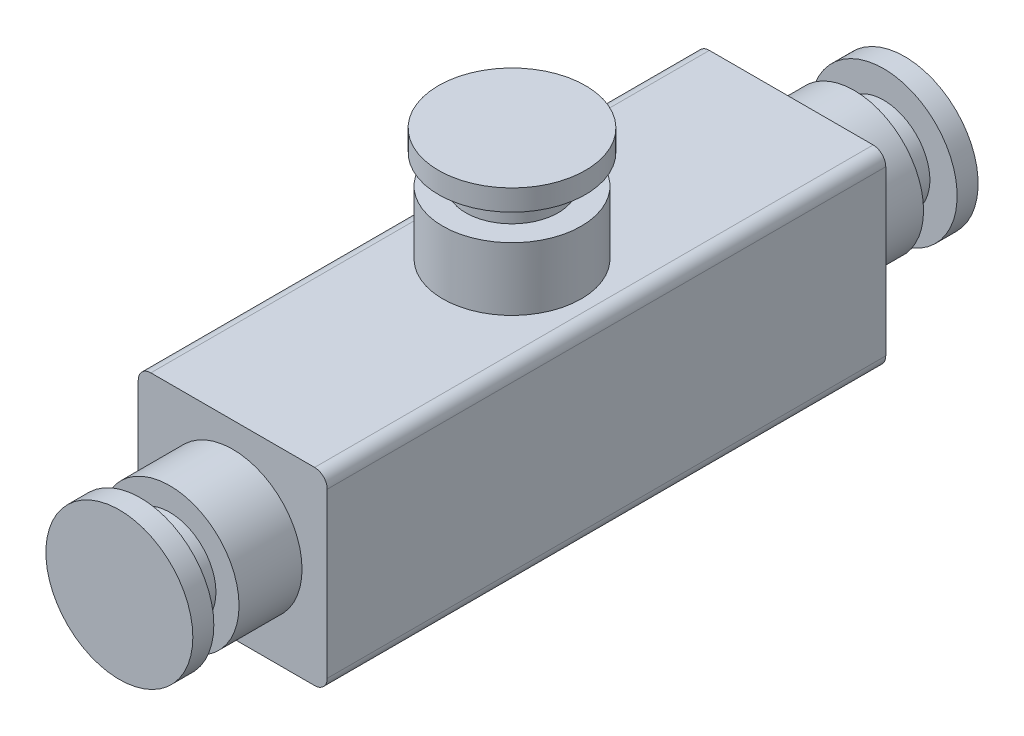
from build123d import *

# Parameters (mm, degrees)
EXTRUDE_2_DEPTH     = 133
SKETCH_2_R          = 16.5
EXTRUDE_3_DEPTH     = 15
SKETCH_3_R          = 16.5
EXTRUDE_4_DEPTH     = 15
EXTRUDE_START       = 15
SKETCH_4_R          = 16.5
EXTRUDE_5_DEPTH     = 15
SKETCH_5_R          = 11
EXTRUDE_6_DEPTH     = 7
SKETCH_6_R          = 11
EXTRUDE_7_DEPTH     = 7
EXTRUDE_START_2     = 7
SKETCH_7_R          = 11
EXTRUDE_8_DEPTH     = 7
SKETCH_8_R          = 17.5
EXTRUDE_9_DEPTH     = 5
SKETCH_9_R          = 17.5
EXTRUDE_10_DEPTH    = 5
EXTRUDE_START_3     = 5
SKETCH_10_R         = 17.5
EXTRUDE_11_DEPTH    = 5
SKETCH_11_R         = 10
CUT_EXTRUDE_1_DEPTH = 5


with BuildPart() as part:
    # Sketch 1 → Extrude 2 (new body)
    with BuildSketch(Plane.XY):
        with BuildLine():
            Line((19.5, 22.5), (-19.5, 22.5))
            ThreePointArc((-19.5, 22.5), (-21.621320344, 21.621320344), (-22.5, 19.5))
            Line((-22.5, 19.5), (-22.5, -19.5))
            ThreePointArc((-22.5, -19.5), (-21.621320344, -21.621320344), (-19.5, -22.5))
            Line((-19.5, -22.5), (19.5, -22.5))
            ThreePointArc((19.5, -22.5), (21.621320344, -21.621320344), (22.5, -19.5))
            Line((22.5, -19.5), (22.5, 19.5))
            ThreePointArc((22.5, 19.5), (21.621320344, 21.621320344), (19.5, 22.5))
        make_face()
    extrude(amount=EXTRUDE_2_DEPTH)

    # Sketch 2 → Extrude 3 (add)
    with BuildSketch(Plane(origin=(0, 22.5, 0), x_dir=(1, 0, 0), z_dir=(0, 1, 0))):
        with Locations((0, -66.5)):
            Circle(SKETCH_2_R)
    extrude(amount=EXTRUDE_3_DEPTH)

    # Sketch 3 → Extrude 4 (add)
    with BuildSketch(Plane.XY.offset(133)):
        Circle(SKETCH_3_R)
    extrude(amount=EXTRUDE_4_DEPTH)

    # Sketch 4 → Extrude 5 (add)
    with BuildSketch(Plane(origin=(0, 0, 0), x_dir=(-1, 0, 0), z_dir=(0, 0, -1)).offset(EXTRUDE_START)):
        with Locations(Location((0, 0, 0), (0, 0, 180))):
            Circle(SKETCH_4_R)
    extrude(amount=-EXTRUDE_5_DEPTH)

    # Sketch 5 → Extrude 6 (add)
    with BuildSketch(Plane(origin=(0, 37.5, 0), x_dir=(1, 0, 0), z_dir=(0, 1, 0))):
        with Locations(Location((0, -66.5, 0), (0, 0, 180))):
            Circle(SKETCH_5_R)
    extrude(amount=EXTRUDE_6_DEPTH)

    # Sketch 6 → Extrude 7 (add)
    with BuildSketch(Plane.XY.offset(148)):
        Circle(SKETCH_6_R)
    extrude(amount=EXTRUDE_7_DEPTH)

    # Sketch 7 → Extrude 8 (add)
    with BuildSketch(Plane(origin=(0, 0, -15), x_dir=(-1, 0, 0), z_dir=(0, 0, -1)).offset(EXTRUDE_START_2)):
        with Locations(Location((0, 0, 0), (0, 0, 180))):
            Circle(SKETCH_7_R)
    extrude(amount=-EXTRUDE_8_DEPTH)

    # Sketch 8 → Extrude 9 (add)
    with BuildSketch(Plane(origin=(0, 44.5, 0), x_dir=(1, 0, 0), z_dir=(0, 1, 0))):
        with Locations(Location((0, -66.5, 0), (0, 0, 180))):
            Circle(SKETCH_8_R)
    extrude(amount=EXTRUDE_9_DEPTH)

    # Sketch 9 → Extrude 10 (add)
    with BuildSketch(Plane(origin=(0, 0, -22), x_dir=(-1, 0, 0), z_dir=(0, 0, -1))):
        Circle(SKETCH_9_R)
    extrude(amount=EXTRUDE_10_DEPTH)

    # Sketch 10 → Extrude 11 (add)
    with BuildSketch(Plane.XY.offset(155).offset(EXTRUDE_START_3)):
        with Locations(Location((0, 0, 0), (0, 0, 180))):
            Circle(SKETCH_10_R)
    extrude(amount=-EXTRUDE_11_DEPTH)

    # Sketch 11 → Cut-Extrude 1 (cut)
    with BuildSketch(Plane.XZ.offset(22.5)):
        with Locations((0, 34.5)):
            Circle(SKETCH_11_R)
    extrude(amount=-CUT_EXTRUDE_1_DEPTH, mode=Mode.SUBTRACT)


solid = part.part
